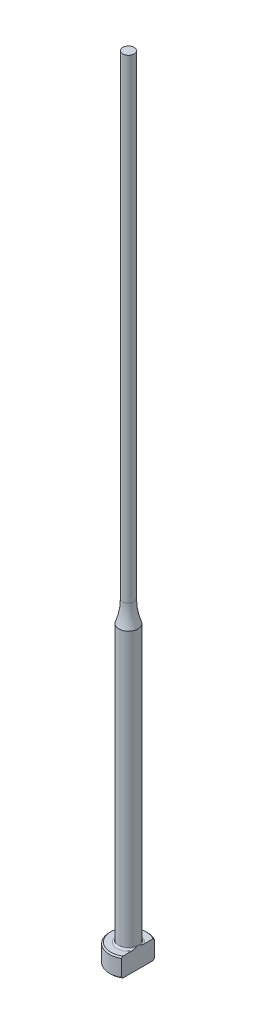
ISO-10303-21;
HEADER;
FILE_DESCRIPTION(('STEP AP214'),'2;1');
FILE_NAME('part.step','',(''),(''),'','','');
FILE_SCHEMA(('AUTOMOTIVE_DESIGN { 1 0 10303 214 1 1 1 1 }'));
ENDSEC;
DATA;
#1=APPLICATION_CONTEXT('core data for automotive mechanical design processes');
#2=APPLICATION_PROTOCOL_DEFINITION('international standard','automotive_design',2000,#1);
#3=PRODUCT_CONTEXT('',#1,'mechanical');
#4=PRODUCT('Part','Part','',(#3));
#5=PRODUCT_RELATED_PRODUCT_CATEGORY('part','',(#4));
#6=PRODUCT_DEFINITION_FORMATION('','',#4);
#7=PRODUCT_DEFINITION_CONTEXT('part definition',#1,'design');
#8=PRODUCT_DEFINITION('design','',#6,#7);
#9=PRODUCT_DEFINITION_SHAPE('','',#8);
#10=(LENGTH_UNIT() NAMED_UNIT(*) SI_UNIT(.MILLI.,.METRE.));
#11=(NAMED_UNIT(*) PLANE_ANGLE_UNIT() SI_UNIT($,.RADIAN.));
#12=(NAMED_UNIT(*) SI_UNIT($,.STERADIAN.) SOLID_ANGLE_UNIT());
#13=UNCERTAINTY_MEASURE_WITH_UNIT(LENGTH_MEASURE(1.E-05),#10,'distance_accuracy_value','');
#14=(GEOMETRIC_REPRESENTATION_CONTEXT(3) GLOBAL_UNCERTAINTY_ASSIGNED_CONTEXT((#13)) GLOBAL_UNIT_ASSIGNED_CONTEXT((#10,
#11,#12)) REPRESENTATION_CONTEXT('',''));
#15=CARTESIAN_POINT('',(0.,0.,0.));
#16=DIRECTION('',(0.,0.,1.));
#17=DIRECTION('',(1.,0.,0.));
#18=AXIS2_PLACEMENT_3D('',#15,#16,#17);
#19=CARTESIAN_POINT('',(-2.99999999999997,3.,0.));
#20=DIRECTION('',(0.,1.,0.));
#21=DIRECTION('',(0.,0.,1.));
#22=AXIS2_PLACEMENT_3D('',#19,#20,#21);
#23=PLANE('',#22);
#24=CARTESIAN_POINT('',(0.,3.,0.));
#25=DIRECTION('',(0.,1.,0.));
#26=DIRECTION('',(0.,0.,1.));
#27=AXIS2_PLACEMENT_3D('',#24,#25,#26);
#28=CIRCLE('',#27,2.79999999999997);
#29=CARTESIAN_POINT('',(1.49999999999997,3.,-2.36431808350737));
#30=VERTEX_POINT('',#29);
#31=CARTESIAN_POINT('',(1.49999999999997,3.,2.36431808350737));
#32=VERTEX_POINT('',#31);
#33=EDGE_CURVE('E187',#30,#32,#28,.T.);
#34=ORIENTED_EDGE('',*,*,#33,.T.);
#35=DIRECTION('',(0.,0.,-1.));
#36=VECTOR('',#35,1.);
#37=CARTESIAN_POINT('',(1.49999999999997,3.,0.));
#38=LINE('',#37,#36);
#39=CARTESIAN_POINT('',(1.49999999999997,3.00000000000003,0.99498743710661));
#40=VERTEX_POINT('',#39);
#41=EDGE_CURVE('E57',#32,#40,#38,.T.);
#42=ORIENTED_EDGE('',*,*,#41,.T.);
#43=CARTESIAN_POINT('',(0.,3.,0.));
#44=DIRECTION('',(0.,1.,0.));
#45=DIRECTION('',(0.,0.,1.));
#46=AXIS2_PLACEMENT_3D('',#43,#44,#45);
#47=CIRCLE('',#46,1.79999999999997);
#48=CARTESIAN_POINT('',(1.49999999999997,3.00000000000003,-0.994987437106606));
#49=VERTEX_POINT('',#48);
#50=EDGE_CURVE('E108',#40,#49,#47,.F.);
#51=ORIENTED_EDGE('',*,*,#50,.T.);
#52=EDGE_CURVE('E137',#49,#30,#38,.T.);
#53=ORIENTED_EDGE('',*,*,#52,.T.);
#54=EDGE_LOOP('',(#34,#42,#51,#53));
#55=FACE_BOUND('',#54,.T.);
#56=ADVANCED_FACE('F32',(#55),#23,.T.);
#57=CARTESIAN_POINT('',(0.,259.958771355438,0.));
#58=DIRECTION('',(0.,1.,0.));
#59=DIRECTION('',(0.,0.,1.));
#60=AXIS2_PLACEMENT_3D('',#57,#58,#59);
#61=CYLINDRICAL_SURFACE('',#60,2.99999999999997);
#62=CARTESIAN_POINT('',(0.,2.80000000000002,0.));
#63=DIRECTION('',(0.,1.,0.));
#64=DIRECTION('',(0.,0.,1.));
#65=AXIS2_PLACEMENT_3D('',#62,#63,#64);
#66=CIRCLE('',#65,2.99999999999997);
#67=CARTESIAN_POINT('',(1.49999999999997,2.80000000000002,2.5980762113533));
#68=VERTEX_POINT('',#67);
#69=CARTESIAN_POINT('',(1.49999999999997,2.80000000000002,-2.5980762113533));
#70=VERTEX_POINT('',#69);
#71=EDGE_CURVE('E105',#68,#70,#66,.F.);
#72=ORIENTED_EDGE('',*,*,#71,.T.);
#73=DIRECTION('',(0.,-1.,0.));
#74=VECTOR('',#73,1.);
#75=CARTESIAN_POINT('',(1.49999999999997,125.,-2.5980762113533));
#76=LINE('',#75,#74);
#77=CARTESIAN_POINT('',(1.49999999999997,0.200000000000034,-2.5980762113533));
#78=VERTEX_POINT('',#77);
#79=EDGE_CURVE('E193',#70,#78,#76,.T.);
#80=ORIENTED_EDGE('',*,*,#79,.T.);
#81=CARTESIAN_POINT('',(0.,0.200000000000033,0.));
#82=DIRECTION('',(0.,-1.,0.));
#83=DIRECTION('',(0.,0.,-1.));
#84=AXIS2_PLACEMENT_3D('',#81,#82,#83);
#85=CIRCLE('',#84,2.99999999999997);
#86=CARTESIAN_POINT('',(1.49999999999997,0.200000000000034,2.5980762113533));
#87=VERTEX_POINT('',#86);
#88=EDGE_CURVE('E100',#78,#87,#85,.F.);
#89=ORIENTED_EDGE('',*,*,#88,.T.);
#90=DIRECTION('',(0.,-1.,0.));
#91=VECTOR('',#90,1.);
#92=CARTESIAN_POINT('',(1.49999999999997,125.,2.5980762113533));
#93=LINE('',#92,#91);
#94=EDGE_CURVE('E93',#68,#87,#93,.T.);
#95=ORIENTED_EDGE('',*,*,#94,.F.);
#96=EDGE_LOOP('',(#72,#80,#89,#95));
#97=FACE_BOUND('',#96,.T.);
#98=ADVANCED_FACE('F158',(#97),#61,.T.);
#99=CARTESIAN_POINT('',(0.,0.,0.));
#100=DIRECTION('',(0.,-1.,0.));
#101=DIRECTION('',(0.,0.,-1.));
#102=AXIS2_PLACEMENT_3D('',#99,#100,#101);
#103=PLANE('',#102);
#104=CARTESIAN_POINT('',(0.,0.,0.));
#105=DIRECTION('',(0.,-1.,0.));
#106=DIRECTION('',(0.,0.,-1.));
#107=AXIS2_PLACEMENT_3D('',#104,#105,#106);
#108=CIRCLE('',#107,2.79999999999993);
#109=CARTESIAN_POINT('',(1.49999999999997,0.,2.36431808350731));
#110=VERTEX_POINT('',#109);
#111=CARTESIAN_POINT('',(1.49999999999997,0.,-2.36431808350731));
#112=VERTEX_POINT('',#111);
#113=EDGE_CURVE('E98',#110,#112,#108,.T.);
#114=ORIENTED_EDGE('',*,*,#113,.T.);
#115=DIRECTION('',(0.,0.,1.));
#116=VECTOR('',#115,1.);
#117=CARTESIAN_POINT('',(1.49999999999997,0.,-2.5980762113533));
#118=LINE('',#117,#116);
#119=EDGE_CURVE('E83',#112,#110,#118,.T.);
#120=ORIENTED_EDGE('',*,*,#119,.T.);
#121=EDGE_LOOP('',(#114,#120));
#122=FACE_BOUND('',#121,.T.);
#123=ADVANCED_FACE('F103',(#122),#103,.T.);
#124=CARTESIAN_POINT('',(0.,3.,0.));
#125=DIRECTION('',(0.,-1.,0.));
#126=DIRECTION('',(0.,0.,-1.));
#127=AXIS2_PLACEMENT_3D('',#124,#125,#126);
#128=CONICAL_SURFACE('',#127,2.79999999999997,0.7853981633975);
#129=ORIENTED_EDGE('',*,*,#71,.F.);
#130=CARTESIAN_POINT('',(1.49999999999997,-0.11174109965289,5.71827621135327));
#131=CARTESIAN_POINT('',(1.49999999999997,0.0136183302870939,5.58866816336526));
#132=CARTESIAN_POINT('',(1.49999999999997,0.138843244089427,5.45892957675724));
#133=CARTESIAN_POINT('',(1.49999999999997,0.388944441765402,5.19911365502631));
#134=CARTESIAN_POINT('',(1.49999999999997,0.513820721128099,5.06903631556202));
#135=CARTESIAN_POINT('',(1.49999999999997,0.763205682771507,4.8084018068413));
#136=CARTESIAN_POINT('',(1.49999999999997,0.887714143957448,4.67784442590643));
#137=CARTESIAN_POINT('',(1.49999999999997,1.13618059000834,4.41620813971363));
#138=CARTESIAN_POINT('',(1.49999999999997,1.2601385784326,4.28512923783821));
#139=CARTESIAN_POINT('',(1.49999999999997,1.50488975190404,4.02490837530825));
#140=CARTESIAN_POINT('',(1.49999999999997,1.6256969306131,3.89577958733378));
#141=CARTESIAN_POINT('',(1.49999999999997,1.86640694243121,3.63668213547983));
#142=CARTESIAN_POINT('',(1.49999999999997,1.98630978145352,3.5067134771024));
#143=CARTESIAN_POINT('',(1.49999999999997,2.22486033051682,3.24567921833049));
#144=CARTESIAN_POINT('',(1.49999999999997,2.34350830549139,3.11461386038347));
#145=CARTESIAN_POINT('',(1.49999999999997,2.57907716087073,2.85094268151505));
#146=CARTESIAN_POINT('',(1.49999999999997,2.69599811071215,2.71833692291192));
#147=CARTESIAN_POINT('',(1.49999999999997,2.88262371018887,2.50255231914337));
#148=CARTESIAN_POINT('',(1.49999999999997,2.95312454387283,2.42006293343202));
#149=CARTESIAN_POINT('',(1.49999999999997,3.09287098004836,2.25401084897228));
#150=CARTESIAN_POINT('',(1.49999999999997,3.16211645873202,2.170448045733));
#151=CARTESIAN_POINT('',(1.49999999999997,3.2996468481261,2.00105967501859));
#152=CARTESIAN_POINT('',(1.49999999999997,3.36791386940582,1.91521952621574));
#153=CARTESIAN_POINT('',(1.49999999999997,3.50205840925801,1.74171392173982));
#154=CARTESIAN_POINT('',(1.49999999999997,3.56793649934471,1.65404891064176));
#155=CARTESIAN_POINT('',(1.49999999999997,3.69728151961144,1.47490236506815));
#156=CARTESIAN_POINT('',(1.49999999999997,3.76069661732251,1.38338308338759));
#157=CARTESIAN_POINT('',(1.49999999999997,3.88239539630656,1.1967566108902));
#158=CARTESIAN_POINT('',(1.49999999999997,3.94067201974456,1.10164473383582));
#159=CARTESIAN_POINT('',(1.49999999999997,4.0484132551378,0.908008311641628));
#160=CARTESIAN_POINT('',(1.49999999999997,4.09797809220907,0.809540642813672));
#161=CARTESIAN_POINT('',(1.49999999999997,4.18432188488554,0.607192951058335));
#162=CARTESIAN_POINT('',(1.49999999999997,4.22114374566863,0.503332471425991));
#163=CARTESIAN_POINT('',(1.49999999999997,4.26099935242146,0.347577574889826));
#164=CARTESIAN_POINT('',(1.49999999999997,4.27157029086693,0.29760995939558));
#165=CARTESIAN_POINT('',(1.49999999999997,4.28794860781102,0.196885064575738));
#166=CARTESIAN_POINT('',(1.49999999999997,4.29375640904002,0.146127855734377));
#167=CARTESIAN_POINT('',(1.49999999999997,4.30019707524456,0.0444388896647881));
#168=CARTESIAN_POINT('',(1.49999999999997,4.30084594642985,-0.00649183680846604));
#169=CARTESIAN_POINT('',(1.49999999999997,4.29696416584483,-0.108155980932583));
#170=CARTESIAN_POINT('',(1.49999999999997,4.29243308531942,-0.158889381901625));
#171=CARTESIAN_POINT('',(1.49999999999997,4.27856915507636,-0.259234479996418));
#172=CARTESIAN_POINT('',(1.49999999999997,4.26927821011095,-0.308852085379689));
#173=CARTESIAN_POINT('',(1.49999999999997,4.24647108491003,-0.407110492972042));
#174=CARTESIAN_POINT('',(1.49999999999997,4.2329532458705,-0.455750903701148));
#175=CARTESIAN_POINT('',(1.49999999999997,4.20226175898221,-0.552149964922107));
#176=CARTESIAN_POINT('',(1.49999999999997,4.18506801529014,-0.599902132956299));
#177=CARTESIAN_POINT('',(1.49999999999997,4.14771387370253,-0.694205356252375));
#178=CARTESIAN_POINT('',(1.49999999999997,4.12755408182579,-0.740756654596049));
#179=CARTESIAN_POINT('',(1.49999999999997,4.06327696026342,-0.879166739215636));
#180=CARTESIAN_POINT('',(1.49999999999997,4.01551721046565,-0.969329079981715));
#181=CARTESIAN_POINT('',(1.49999999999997,3.91367909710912,-1.1460431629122));
#182=CARTESIAN_POINT('',(1.49999999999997,3.85959300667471,-1.23259031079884));
#183=CARTESIAN_POINT('',(1.49999999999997,3.74697968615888,-1.40321348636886));
#184=CARTESIAN_POINT('',(1.49999999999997,3.68843573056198,-1.48727838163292));
#185=CARTESIAN_POINT('',(1.49999999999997,3.56843845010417,-1.65322187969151));
#186=CARTESIAN_POINT('',(1.49999999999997,3.50698656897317,-1.73510153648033));
#187=CARTESIAN_POINT('',(1.49999999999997,3.38115673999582,-1.89829823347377));
#188=CARTESIAN_POINT('',(1.49999999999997,3.31675092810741,-1.9795936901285));
#189=CARTESIAN_POINT('',(1.49999999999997,3.18634068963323,-2.14090082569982));
#190=CARTESIAN_POINT('',(1.49999999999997,3.12033609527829,-2.22091236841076));
#191=CARTESIAN_POINT('',(1.49999999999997,2.9208643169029,-2.4590650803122));
#192=CARTESIAN_POINT('',(1.49999999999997,2.78562663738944,-2.6157209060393));
#193=CARTESIAN_POINT('',(1.49999999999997,2.53554498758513,-2.90006295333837));
#194=CARTESIAN_POINT('',(1.49999999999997,2.421145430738,-3.02814382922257));
#195=CARTESIAN_POINT('',(1.49999999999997,2.19093557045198,-3.28303767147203));
#196=CARTESIAN_POINT('',(1.49999999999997,2.07512522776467,-3.40985060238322));
#197=CARTESIAN_POINT('',(1.49999999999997,1.72597067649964,-3.78913849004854));
#198=CARTESIAN_POINT('',(1.49999999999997,1.49111760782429,-4.04022177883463));
#199=CARTESIAN_POINT('',(1.49999999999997,1.02882478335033,-4.52992803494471));
#200=CARTESIAN_POINT('',(1.49999999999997,0.801477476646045,-4.76863870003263));
#201=CARTESIAN_POINT('',(1.49999999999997,0.459548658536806,-5.12558036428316));
#202=CARTESIAN_POINT('',(1.49999999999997,0.345484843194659,-5.24430773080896));
#203=CARTESIAN_POINT('',(1.49999999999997,0.117071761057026,-5.48148573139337));
#204=CARTESIAN_POINT('',(1.49999999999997,0.00272249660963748,-5.59993636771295));
#205=CARTESIAN_POINT('',(1.49999999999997,-0.111741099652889,-5.71827621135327));
#206=B_SPLINE_CURVE_WITH_KNOTS('',3,(#130,#131,#132,#133,#134,#135,#136,#137,#138,#139,#140,
#141,#142,#143,#144,#145,#146,#147,#148,#149,#150,#151,#152,#153,#154,#155,#156,#157,#158,#159,
#160,#161,#162,#163,#164,#165,#166,#167,#168,#169,#170,#171,#172,#173,#174,#175,#176,#177,#178,
#179,#180,#181,#182,#183,#184,#185,#186,#187,#188,#189,#190,#191,#192,#193,#194,#195,#196,#197,
#198,#199,#200,#201,#202,#203,#204,#205),.UNSPECIFIED.,.F.,.F.,(4,2,2,2,2,2,2,2,2,2,2,2,2,2,2,2,
2,2,2,2,2,2,2,2,2,2,2,2,2,2,2,2,2,2,2,2,2,4),(0.,0.540943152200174,1.08189327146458,
1.62312052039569,2.16434426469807,2.69482920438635,3.22531067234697,3.75567781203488,
4.28602356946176,4.61155053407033,4.93710943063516,5.26610945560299,5.59503024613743,
5.92894782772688,6.26331713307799,6.59354403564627,6.92264800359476,7.07567478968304,
7.22868799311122,7.38122626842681,7.53377717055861,7.68500755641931,7.83629736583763,
7.98843643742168,8.14054446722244,8.4461879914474,8.75220879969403,9.05944044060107,
9.366521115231,9.677642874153,9.98879742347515,10.6095925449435,11.1247803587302,
11.6399825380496,12.6713544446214,13.6603005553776,14.1542238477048,14.648143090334),.UNSPECIFIED.);
#207=EDGE_CURVE('E136',#68,#32,#206,.T.);
#208=ORIENTED_EDGE('',*,*,#207,.T.);
#209=ORIENTED_EDGE('',*,*,#33,.F.);
#210=EDGE_CURVE('E128',#30,#70,#206,.T.);
#211=ORIENTED_EDGE('',*,*,#210,.T.);
#212=EDGE_LOOP('',(#129,#208,#209,#211));
#213=FACE_BOUND('',#212,.T.);
#214=ADVANCED_FACE('F144',(#213),#128,.T.);
#215=CARTESIAN_POINT('',(0.,0.200000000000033,0.));
#216=DIRECTION('',(0.,1.,0.));
#217=DIRECTION('',(0.,0.,1.));
#218=AXIS2_PLACEMENT_3D('',#215,#216,#217);
#219=CONICAL_SURFACE('',#218,2.99999999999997,0.785398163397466);
#220=ORIENTED_EDGE('',*,*,#88,.F.);
#221=CARTESIAN_POINT('',(1.49999999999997,3.11174109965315,-5.71827621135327));
#222=CARTESIAN_POINT('',(1.49999999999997,2.98638166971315,-5.58866816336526));
#223=CARTESIAN_POINT('',(1.49999999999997,2.8611567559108,-5.45892957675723));
#224=CARTESIAN_POINT('',(1.49999999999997,2.6110555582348,-5.19911365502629));
#225=CARTESIAN_POINT('',(1.49999999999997,2.48617927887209,-5.06903631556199));
#226=CARTESIAN_POINT('',(1.49999999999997,2.23679431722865,-4.80840180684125));
#227=CARTESIAN_POINT('',(1.49999999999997,2.11228585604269,-4.67784442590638));
#228=CARTESIAN_POINT('',(1.49999999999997,1.86381940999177,-4.41620813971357));
#229=CARTESIAN_POINT('',(1.49999999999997,1.7398614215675,-4.28512923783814));
#230=CARTESIAN_POINT('',(1.49999999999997,1.49511024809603,-4.02490837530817));
#231=CARTESIAN_POINT('',(1.49999999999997,1.37430306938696,-3.89577958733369));
#232=CARTESIAN_POINT('',(1.49999999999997,1.13359305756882,-3.63668213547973));
#233=CARTESIAN_POINT('',(1.49999999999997,1.0136902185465,-3.50671347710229));
#234=CARTESIAN_POINT('',(1.49999999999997,0.775139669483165,-3.24567921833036));
#235=CARTESIAN_POINT('',(1.49999999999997,0.656491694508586,-3.11461386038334));
#236=CARTESIAN_POINT('',(1.49999999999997,0.420922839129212,-2.85094268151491));
#237=CARTESIAN_POINT('',(1.49999999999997,0.304001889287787,-2.71833692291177));
#238=CARTESIAN_POINT('',(1.49999999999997,0.117376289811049,-2.50255231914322));
#239=CARTESIAN_POINT('',(1.49999999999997,0.0468754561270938,-2.42006293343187));
#240=CARTESIAN_POINT('',(1.49999999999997,-0.0928709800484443,-2.25401084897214));
#241=CARTESIAN_POINT('',(1.49999999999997,-0.162116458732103,-2.17044804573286));
#242=CARTESIAN_POINT('',(1.49999999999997,-0.299646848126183,-2.00105967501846));
#243=CARTESIAN_POINT('',(1.49999999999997,-0.367913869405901,-1.91521952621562));
#244=CARTESIAN_POINT('',(1.49999999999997,-0.502058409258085,-1.74171392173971));
#245=CARTESIAN_POINT('',(1.49999999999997,-0.567936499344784,-1.65404891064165));
#246=CARTESIAN_POINT('',(1.49999999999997,-0.697281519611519,-1.47490236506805));
#247=CARTESIAN_POINT('',(1.49999999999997,-0.760696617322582,-1.38338308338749));
#248=CARTESIAN_POINT('',(1.49999999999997,-0.882395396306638,-1.19675661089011));
#249=CARTESIAN_POINT('',(1.49999999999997,-0.940672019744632,-1.10164473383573));
#250=CARTESIAN_POINT('',(1.49999999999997,-1.04841325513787,-0.908008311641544));
#251=CARTESIAN_POINT('',(1.49999999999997,-1.09797809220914,-0.809540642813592));
#252=CARTESIAN_POINT('',(1.49999999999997,-1.1843218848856,-0.60719295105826));
#253=CARTESIAN_POINT('',(1.49999999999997,-1.22114374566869,-0.503332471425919));
#254=CARTESIAN_POINT('',(1.49999999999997,-1.26099935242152,-0.347577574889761));
#255=CARTESIAN_POINT('',(1.49999999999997,-1.27157029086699,-0.29760995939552));
#256=CARTESIAN_POINT('',(1.49999999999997,-1.28794860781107,-0.196885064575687));
#257=CARTESIAN_POINT('',(1.49999999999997,-1.29375640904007,-0.146127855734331));
#258=CARTESIAN_POINT('',(1.49999999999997,-1.30019707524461,-0.0444388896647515));
#259=CARTESIAN_POINT('',(1.49999999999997,-1.3008459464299,0.00649183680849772));
#260=CARTESIAN_POINT('',(1.49999999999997,-1.29696416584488,0.108155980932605));
#261=CARTESIAN_POINT('',(1.49999999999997,-1.29243308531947,0.158889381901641));
#262=CARTESIAN_POINT('',(1.49999999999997,-1.2785691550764,0.259234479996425));
#263=CARTESIAN_POINT('',(1.49999999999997,-1.26927821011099,0.308852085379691));
#264=CARTESIAN_POINT('',(1.49999999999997,-1.24647108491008,0.407110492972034));
#265=CARTESIAN_POINT('',(1.49999999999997,-1.23295324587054,0.455750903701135));
#266=CARTESIAN_POINT('',(1.49999999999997,-1.20226175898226,0.552149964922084));
#267=CARTESIAN_POINT('',(1.49999999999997,-1.18506801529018,0.599902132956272));
#268=CARTESIAN_POINT('',(1.49999999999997,-1.14771387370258,0.694205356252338));
#269=CARTESIAN_POINT('',(1.49999999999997,-1.12755408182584,0.740756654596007));
#270=CARTESIAN_POINT('',(1.49999999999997,-1.06327696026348,0.879166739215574));
#271=CARTESIAN_POINT('',(1.49999999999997,-1.01551721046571,0.969329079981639));
#272=CARTESIAN_POINT('',(1.49999999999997,-0.913679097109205,1.1460431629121));
#273=CARTESIAN_POINT('',(1.49999999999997,-0.8595930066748,1.23259031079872));
#274=CARTESIAN_POINT('',(1.49999999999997,-0.746979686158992,1.40321348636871));
#275=CARTESIAN_POINT('',(1.49999999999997,-0.688435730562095,1.48727838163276));
#276=CARTESIAN_POINT('',(1.49999999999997,-0.568438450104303,1.65322187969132));
#277=CARTESIAN_POINT('',(1.49999999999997,-0.506986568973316,1.73510153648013));
#278=CARTESIAN_POINT('',(1.49999999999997,-0.381156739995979,1.89829823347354));
#279=CARTESIAN_POINT('',(1.49999999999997,-0.316750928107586,1.97959369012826));
#280=CARTESIAN_POINT('',(1.49999999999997,-0.186340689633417,2.14090082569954));
#281=CARTESIAN_POINT('',(1.49999999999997,-0.120336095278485,2.22091236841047));
#282=CARTESIAN_POINT('',(1.49999999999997,0.0791356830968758,2.45906508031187));
#283=CARTESIAN_POINT('',(1.49999999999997,0.214373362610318,2.61572090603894));
#284=CARTESIAN_POINT('',(1.49999999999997,0.46445501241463,2.90006295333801));
#285=CARTESIAN_POINT('',(1.49999999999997,0.578854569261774,3.02814382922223));
#286=CARTESIAN_POINT('',(1.49999999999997,0.809064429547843,3.28303767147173));
#287=CARTESIAN_POINT('',(1.49999999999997,0.924874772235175,3.40985060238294));
#288=CARTESIAN_POINT('',(1.49999999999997,1.27402932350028,3.78913849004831));
#289=CARTESIAN_POINT('',(1.49999999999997,1.50888239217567,4.04022177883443));
#290=CARTESIAN_POINT('',(1.49999999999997,1.97117521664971,4.52992803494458));
#291=CARTESIAN_POINT('',(1.49999999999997,2.19852252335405,4.76863870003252));
#292=CARTESIAN_POINT('',(1.49999999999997,2.54045134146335,5.12558036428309));
#293=CARTESIAN_POINT('',(1.49999999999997,2.65451515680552,5.2443077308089));
#294=CARTESIAN_POINT('',(1.49999999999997,2.88292823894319,5.48148573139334));
#295=CARTESIAN_POINT('',(1.49999999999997,2.9972775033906,5.59993636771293));
#296=CARTESIAN_POINT('',(1.49999999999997,3.11174109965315,5.71827621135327));
#297=B_SPLINE_CURVE_WITH_KNOTS('',3,(#221,#222,#223,#224,#225,#226,#227,#228,#229,#230,#231,
#232,#233,#234,#235,#236,#237,#238,#239,#240,#241,#242,#243,#244,#245,#246,#247,#248,#249,#250,
#251,#252,#253,#254,#255,#256,#257,#258,#259,#260,#261,#262,#263,#264,#265,#266,#267,#268,#269,
#270,#271,#272,#273,#274,#275,#276,#277,#278,#279,#280,#281,#282,#283,#284,#285,#286,#287,#288,
#289,#290,#291,#292,#293,#294,#295,#296),.UNSPECIFIED.,.F.,.F.,(4,2,2,2,2,2,2,2,2,2,2,2,2,2,2,2,
2,2,2,2,2,2,2,2,2,2,2,2,2,2,2,2,2,2,2,2,2,4),(0.,0.540943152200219,1.08189327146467,
1.62312052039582,2.16434426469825,2.69482920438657,3.22531067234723,3.75567781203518,
4.28602356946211,4.61155053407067,4.93710943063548,5.2661094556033,5.59503024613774,
5.92894782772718,6.26331713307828,6.59354403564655,6.92264800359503,7.0756747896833,
7.22868799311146,7.38122626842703,7.53377717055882,7.68500755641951,7.83629736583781,
7.98843643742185,8.14054446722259,8.4461879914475,8.75220879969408,9.05944044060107,
9.36652111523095,9.6776428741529,9.98879742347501,10.6095925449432,11.1247803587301,
11.6399825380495,12.6713544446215,13.6603005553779,14.1542238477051,14.6481430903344),.UNSPECIFIED.);
#298=EDGE_CURVE('E86',#78,#112,#297,.T.);
#299=ORIENTED_EDGE('',*,*,#298,.T.);
#300=ORIENTED_EDGE('',*,*,#113,.F.);
#301=EDGE_CURVE('E89',#110,#87,#297,.T.);
#302=ORIENTED_EDGE('',*,*,#301,.T.);
#303=EDGE_LOOP('',(#220,#299,#300,#302));
#304=FACE_BOUND('',#303,.T.);
#305=ADVANCED_FACE('F97',(#304),#219,.T.);
#306=CARTESIAN_POINT('',(0.,3.30000000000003,0.));
#307=DIRECTION('',(0.,1.,0.));
#308=DIRECTION('',(0.,0.,1.));
#309=AXIS2_PLACEMENT_3D('',#306,#307,#308);
#310=TOROIDAL_SURFACE('',#309,1.79999999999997,0.3);
#311=CARTESIAN_POINT('',(1.49999999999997,3.30000000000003,0.));
#312=CARTESIAN_POINT('',(1.49999999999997,3.300000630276,3.41555678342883E-12));
#313=CARTESIAN_POINT('',(1.49999999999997,3.30000126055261,-1.15373640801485E-07));
#314=CARTESIAN_POINT('',(1.49999999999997,3.3000024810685,-4.90631575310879E-07));
#315=CARTESIAN_POINT('',(1.49999999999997,3.30000307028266,-7.53296670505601E-07));
#316=CARTESIAN_POINT('',(1.49999999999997,3.30000424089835,-1.38757096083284E-06));
#317=CARTESIAN_POINT('',(1.49999999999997,3.300004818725,-1.76563001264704E-06));
#318=CARTESIAN_POINT('',(1.49999999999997,3.30000591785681,-2.58768006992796E-06));
#319=CARTESIAN_POINT('',(1.49999999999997,3.30000643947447,-3.03127014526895E-06));
#320=CARTESIAN_POINT('',(1.49999999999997,3.30000815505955,-4.60021967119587E-06));
#321=CARTESIAN_POINT('',(1.49999999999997,3.30000927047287,-5.8124152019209E-06));
#322=CARTESIAN_POINT('',(1.49999999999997,3.30001128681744,-8.33989413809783E-06));
#323=CARTESIAN_POINT('',(1.49999999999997,3.30001219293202,-9.65128157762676E-06));
#324=CARTESIAN_POINT('',(1.49999999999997,3.30001551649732,-1.46782505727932E-05));
#325=CARTESIAN_POINT('',(1.49999999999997,3.30001775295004,-1.8517976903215E-05));
#326=CARTESIAN_POINT('',(1.49999999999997,3.30002148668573,-2.61616194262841E-05));
#327=CARTESIAN_POINT('',(1.49999999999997,3.30002302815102,-2.99447742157E-05));
#328=CARTESIAN_POINT('',(1.49999999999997,3.30002943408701,-4.58003743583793E-05));
#329=CARTESIAN_POINT('',(1.49999999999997,3.3000341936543,-5.79079078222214E-05));
#330=CARTESIAN_POINT('',(1.49999999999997,3.30004197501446,-8.07263755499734E-05));
#331=CARTESIAN_POINT('',(1.49999999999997,3.30004514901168,-9.13834709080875E-05));
#332=CARTESIAN_POINT('',(1.49999999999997,3.30006989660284,-0.000167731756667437));
#333=CARTESIAN_POINT('',(1.49999999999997,3.30010092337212,-0.000229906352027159));
#334=CARTESIAN_POINT('',(1.49999999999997,3.30021632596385,-0.000470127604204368));
#335=CARTESIAN_POINT('',(1.49999999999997,3.30029368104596,-0.000650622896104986));
#336=CARTESIAN_POINT('',(1.49999999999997,3.30059619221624,-0.00134589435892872));
#337=CARTESIAN_POINT('',(1.49999999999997,3.30082870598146,-0.00185814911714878));
#338=CARTESIAN_POINT('',(1.49999999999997,3.30176696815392,-0.00393547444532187));
#339=CARTESIAN_POINT('',(1.49999999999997,3.30246445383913,-0.00550332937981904));
#340=CARTESIAN_POINT('',(1.49999999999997,3.31426785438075,-0.0320229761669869));
#341=CARTESIAN_POINT('',(1.49999999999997,3.32544800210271,-0.0569503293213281));
#342=CARTESIAN_POINT('',(1.49999999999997,3.34725700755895,-0.105984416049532));
#343=CARTESIAN_POINT('',(1.49999999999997,3.35789134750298,-0.130088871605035));
#344=CARTESIAN_POINT('',(1.49999999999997,3.38015321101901,-0.181096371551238));
#345=CARTESIAN_POINT('',(1.49999999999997,3.39175804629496,-0.208009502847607));
#346=CARTESIAN_POINT('',(1.49999999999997,3.41469034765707,-0.262264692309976));
#347=CARTESIAN_POINT('',(1.49999999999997,3.42601398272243,-0.289608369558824));
#348=CARTESIAN_POINT('',(1.49999999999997,3.45363212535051,-0.35820378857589));
#349=CARTESIAN_POINT('',(1.49999999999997,3.46959026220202,-0.39959288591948));
#350=CARTESIAN_POINT('',(1.49999999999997,3.49940505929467,-0.482097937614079));
#351=CARTESIAN_POINT('',(1.49999999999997,3.51330033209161,-0.523199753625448));
#352=CARTESIAN_POINT('',(1.49999999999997,3.53552507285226,-0.595497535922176));
#353=CARTESIAN_POINT('',(1.49999999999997,3.54436834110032,-0.626532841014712));
#354=CARTESIAN_POINT('',(1.49999999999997,3.56052427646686,-0.6891760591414));
#355=CARTESIAN_POINT('',(1.49999999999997,3.5678279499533,-0.720786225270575));
#356=CARTESIAN_POINT('',(1.49999999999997,3.5875075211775,-0.819524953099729));
#357=CARTESIAN_POINT('',(1.49999999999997,3.59661044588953,-0.88742909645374));
#358=CARTESIAN_POINT('',(1.49999999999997,3.60059842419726,-0.991180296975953));
#359=CARTESIAN_POINT('',(1.49999999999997,3.60019840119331,-1.02684364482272));
#360=CARTESIAN_POINT('',(1.49999999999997,3.59497085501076,-1.097505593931));
#361=CARTESIAN_POINT('',(1.49999999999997,3.59019295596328,-1.13250716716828));
#362=CARTESIAN_POINT('',(1.49999999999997,3.57687734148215,-1.19353096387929));
#363=CARTESIAN_POINT('',(1.49999999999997,3.56943875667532,-1.21978854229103));
#364=CARTESIAN_POINT('',(1.49999999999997,3.55063748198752,-1.27094658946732));
#365=CARTESIAN_POINT('',(1.49999999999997,3.53927342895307,-1.29584658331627));
#366=CARTESIAN_POINT('',(1.49999999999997,3.51660016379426,-1.33501873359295));
#367=CARTESIAN_POINT('',(1.49999999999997,3.50657738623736,-1.35003296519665));
#368=CARTESIAN_POINT('',(1.49999999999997,3.48437469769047,-1.37837252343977));
#369=CARTESIAN_POINT('',(1.49999999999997,3.47219867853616,-1.39170082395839));
#370=CARTESIAN_POINT('',(1.49999999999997,3.44835614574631,-1.41349417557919));
#371=CARTESIAN_POINT('',(1.49999999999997,3.43709185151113,-1.42239673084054));
#372=CARTESIAN_POINT('',(1.49999999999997,3.41325256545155,-1.43825467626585));
#373=CARTESIAN_POINT('',(1.49999999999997,3.40067804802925,-1.44521076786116));
#374=CARTESIAN_POINT('',(1.49999999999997,3.37433767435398,-1.45677158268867));
#375=CARTESIAN_POINT('',(1.49999999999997,3.36056203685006,-1.46135438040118));
#376=CARTESIAN_POINT('',(1.49999999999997,3.33237324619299,-1.46767730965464));
#377=CARTESIAN_POINT('',(1.49999999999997,3.31796076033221,-1.46942034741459));
#378=CARTESIAN_POINT('',(1.49999999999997,3.29122479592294,-1.4698720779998));
#379=CARTESIAN_POINT('',(1.49999999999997,3.27890664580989,-1.468990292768));
#380=CARTESIAN_POINT('',(1.49999999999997,3.25461019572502,-1.4651157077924));
#381=CARTESIAN_POINT('',(1.49999999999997,3.2426318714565,-1.46212305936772));
#382=CARTESIAN_POINT('',(1.49999999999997,3.21959683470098,-1.4543117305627));
#383=CARTESIAN_POINT('',(1.49999999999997,3.20852542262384,-1.44953579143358));
#384=CARTESIAN_POINT('',(1.49999999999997,3.18721125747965,-1.43840957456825));
#385=CARTESIAN_POINT('',(1.49999999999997,3.1769687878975,-1.43205876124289));
#386=CARTESIAN_POINT('',(1.49999999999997,3.15325976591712,-1.41506353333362));
#387=CARTESIAN_POINT('',(1.49999999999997,3.14027750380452,-1.40374235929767));
#388=CARTESIAN_POINT('',(1.49999999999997,3.11630720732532,-1.37914825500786));
#389=CARTESIAN_POINT('',(1.49999999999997,3.10532420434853,-1.36587054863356));
#390=CARTESIAN_POINT('',(1.49999999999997,3.08100891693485,-1.33197272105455));
#391=CARTESIAN_POINT('',(1.49999999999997,3.06867625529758,-1.31063843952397));
#392=CARTESIAN_POINT('',(1.49999999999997,3.04751867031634,-1.26637455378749));
#393=CARTESIAN_POINT('',(1.49999999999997,3.03869240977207,-1.24344556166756));
#394=CARTESIAN_POINT('',(1.49999999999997,3.01978360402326,-1.18316534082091));
#395=CARTESIAN_POINT('',(1.49999999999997,3.01191472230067,-1.14512623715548));
#396=CARTESIAN_POINT('',(1.49999999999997,3.00188285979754,-1.06789971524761));
#397=CARTESIAN_POINT('',(1.49999999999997,2.99979735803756,-1.02870374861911));
#398=CARTESIAN_POINT('',(1.49999999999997,3.00021727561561,-0.953160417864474));
#399=CARTESIAN_POINT('',(1.49999999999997,3.00240673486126,-0.916808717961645));
#400=CARTESIAN_POINT('',(1.49999999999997,3.0099643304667,-0.844432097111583));
#401=CARTESIAN_POINT('',(1.49999999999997,3.01533462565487,-0.808407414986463));
#402=CARTESIAN_POINT('',(1.49999999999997,3.02828086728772,-0.738670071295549));
#403=CARTESIAN_POINT('',(1.49999999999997,3.03573028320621,-0.704933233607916));
#404=CARTESIAN_POINT('',(1.49999999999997,3.05243174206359,-0.638128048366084));
#405=CARTESIAN_POINT('',(1.49999999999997,3.06167285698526,-0.605056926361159));
#406=CARTESIAN_POINT('',(1.49999999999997,3.08440652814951,-0.53019513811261));
#407=CARTESIAN_POINT('',(1.49999999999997,3.09836576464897,-0.488547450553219));
#408=CARTESIAN_POINT('',(1.49999999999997,3.1283820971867,-0.404954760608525));
#409=CARTESIAN_POINT('',(1.49999999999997,3.14447968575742,-0.363024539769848));
#410=CARTESIAN_POINT('',(1.49999999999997,3.17238454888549,-0.293508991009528));
#411=CARTESIAN_POINT('',(1.49999999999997,3.18384249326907,-0.265781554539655));
#412=CARTESIAN_POINT('',(1.49999999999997,3.20705854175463,-0.210769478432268));
#413=CARTESIAN_POINT('',(1.49999999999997,3.21881265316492,-0.183483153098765));
#414=CARTESIAN_POINT('',(1.49999999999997,3.24136702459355,-0.131772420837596));
#415=CARTESIAN_POINT('',(1.49999999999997,3.25214361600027,-0.107337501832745));
#416=CARTESIAN_POINT('',(1.49999999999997,3.27424746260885,-0.0576321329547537));
#417=CARTESIAN_POINT('',(1.49999999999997,3.28558038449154,-0.0323640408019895));
#418=CARTESIAN_POINT('',(1.49999999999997,3.29753556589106,-0.00550327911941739));
#419=CARTESIAN_POINT('',(1.49999999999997,3.29823307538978,-0.00393537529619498));
#420=CARTESIAN_POINT('',(1.49999999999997,3.29917134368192,-0.00185803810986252));
#421=CARTESIAN_POINT('',(1.49999999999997,3.29940384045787,-0.00134582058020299));
#422=CARTESIAN_POINT('',(1.49999999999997,3.29970633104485,-0.000650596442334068));
#423=CARTESIAN_POINT('',(1.49999999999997,3.29978368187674,-0.000470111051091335));
#424=CARTESIAN_POINT('',(1.49999999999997,3.29989907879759,-0.000229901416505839));
#425=CARTESIAN_POINT('',(1.49999999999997,3.29993010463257,-0.000167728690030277));
#426=CARTESIAN_POINT('',(1.49999999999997,3.29995485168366,-9.13825689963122E-05));
#427=CARTESIAN_POINT('',(1.49999999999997,3.29995802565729,-8.07256241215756E-05));
#428=CARTESIAN_POINT('',(1.49999999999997,3.29996580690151,-5.79074820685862E-05));
#429=CARTESIAN_POINT('',(1.49999999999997,3.29997056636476,-4.5800119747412E-05));
#430=CARTESIAN_POINT('',(1.49999999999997,3.29997697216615,-2.99447119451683E-05));
#431=CARTESIAN_POINT('',(1.49999999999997,3.2999785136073,-2.61615817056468E-05));
#432=CARTESIAN_POINT('',(1.49999999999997,3.2999822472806,-1.85179845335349E-05));
#433=CARTESIAN_POINT('',(1.49999999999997,3.29998448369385,-1.46782782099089E-05));
#434=CARTESIAN_POINT('',(1.49999999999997,3.2999878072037,-9.65132752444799E-06));
#435=CARTESIAN_POINT('',(1.49999999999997,3.299988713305,-8.33994202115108E-06));
#436=CARTESIAN_POINT('',(1.49999999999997,3.29999072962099,-5.81246426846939E-06));
#437=CARTESIAN_POINT('',(1.49999999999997,3.29999184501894,-4.600267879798E-06));
#438=CARTESIAN_POINT('',(1.49999999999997,3.29999356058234,-3.03131394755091E-06));
#439=CARTESIAN_POINT('',(1.49999999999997,3.29999408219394,-2.58772196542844E-06));
#440=CARTESIAN_POINT('',(1.49999999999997,3.2999951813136,-1.76566701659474E-06));
#441=CARTESIAN_POINT('',(1.49999999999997,3.29999575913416,-1.38760497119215E-06));
#442=CARTESIAN_POINT('',(1.49999999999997,3.29999692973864,-7.53323425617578E-07));
#443=CARTESIAN_POINT('',(1.49999999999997,3.29999751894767,-4.90654189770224E-07));
#444=CARTESIAN_POINT('',(1.49999999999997,3.29999873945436,-1.15386267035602E-07));
#445=CARTESIAN_POINT('',(1.49999999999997,3.29999936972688,-3.41554144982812E-12));
#446=CARTESIAN_POINT('',(1.49999999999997,3.30000000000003,0.));
#447=B_SPLINE_CURVE_WITH_KNOTS('',3,(#311,#312,#313,#314,#315,#316,#317,#318,#319,#320,#321,
#322,#323,#324,#325,#326,#327,#328,#329,#330,#331,#332,#333,#334,#335,#336,#337,#338,#339,#340,
#341,#342,#343,#344,#345,#346,#347,#348,#349,#350,#351,#352,#353,#354,#355,#356,#357,#358,#359,
#360,#361,#362,#363,#364,#365,#366,#367,#368,#369,#370,#371,#372,#373,#374,#375,#376,#377,#378,
#379,#380,#381,#382,#383,#384,#385,#386,#387,#388,#389,#390,#391,#392,#393,#394,#395,#396,#397,
#398,#399,#400,#401,#402,#403,#404,#405,#406,#407,#408,#409,#410,#411,#412,#413,#414,#415,#416,
#417,#418,#419,#420,#421,#422,#423,#424,#425,#426,#427,#428,#429,#430,#431,#432,#433,#434,#435,
#436,#437,#438,#439,#440,#441,#442,#443,#444,#445,#446),.UNSPECIFIED.,.T.,.F.,(4,2,2,2,2,2,2,2,
2,2,2,2,2,2,2,2,2,2,2,2,2,2,2,2,2,2,2,2,2,2,2,2,2,2,2,2,2,2,2,2,2,2,2,2,2,2,2,2,2,2,2,2,2,2,2,2,
2,2,2,2,2,2,2,2,2,2,2,4),(0.,1.88906036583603E-06,3.8150959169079E-06,5.87892837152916E-06,
7.93062024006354E-06,1.28480890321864E-05,1.76261717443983E-05,3.0909918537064E-05,
4.31529750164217E-05,8.21699329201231E-05,0.000115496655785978,0.000323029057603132,
0.000912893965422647,0.00259963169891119,0.00774858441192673,0.0896975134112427,
0.168737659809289,0.256660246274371,0.345444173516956,0.478492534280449,0.608603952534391,
0.705372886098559,0.802692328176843,1.00719557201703,1.11399616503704,1.21960092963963,
1.30124317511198,1.38291380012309,1.43690814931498,1.49080588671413,1.53371524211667,
1.57660911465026,1.61989249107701,1.66313154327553,1.69999492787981,1.73685567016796,
1.77288440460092,1.80892540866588,1.86031324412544,1.91182866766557,1.98534297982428,
2.05882922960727,2.1747172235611,2.29215041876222,2.40123170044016,2.51038710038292,
2.613972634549,2.71694519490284,2.84866234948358,2.98337525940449,3.07337666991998,
3.16250453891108,3.24262397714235,3.32569301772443,3.3308421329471,3.33252874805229,
3.33311858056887,3.33332610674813,3.33335943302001,3.33339844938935,3.3334106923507,
3.33342397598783,3.33342875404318,3.33343367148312,3.33343572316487,3.33343778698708,
3.33343971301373,3.33344160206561),.UNSPECIFIED.);
#448=CARTESIAN_POINT('',(1.49999999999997,3.30000000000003,0.));
#449=VERTEX_POINT('',#448);
#450=EDGE_CURVE('E11',#49,#449,#447,.T.);
#451=ORIENTED_EDGE('',*,*,#450,.F.);
#452=ORIENTED_EDGE('',*,*,#50,.F.);
#453=CARTESIAN_POINT('',(1.49999999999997,3.30000000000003,0.));
#454=CARTESIAN_POINT('',(1.49999999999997,3.29999936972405,-3.41547770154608E-12));
#455=CARTESIAN_POINT('',(1.49999999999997,3.29999873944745,1.15373640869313E-07));
#456=CARTESIAN_POINT('',(1.49999999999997,3.29999751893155,4.90631575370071E-07));
#457=CARTESIAN_POINT('',(1.49999999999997,3.29999692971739,7.53296670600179E-07));
#458=CARTESIAN_POINT('',(1.49999999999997,3.2999957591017,1.38757096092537E-06));
#459=CARTESIAN_POINT('',(1.49999999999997,3.29999518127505,1.76563001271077E-06));
#460=CARTESIAN_POINT('',(1.49999999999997,3.29999408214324,2.58768007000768E-06));
#461=CARTESIAN_POINT('',(1.49999999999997,3.29999356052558,3.03127014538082E-06));
#462=CARTESIAN_POINT('',(1.49999999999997,3.2999918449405,4.60021967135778E-06));
#463=CARTESIAN_POINT('',(1.49999999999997,3.29999072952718,5.81241520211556E-06));
#464=CARTESIAN_POINT('',(1.49999999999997,3.29998871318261,8.33989413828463E-06));
#465=CARTESIAN_POINT('',(1.49999999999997,3.29998780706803,9.65128157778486E-06));
#466=CARTESIAN_POINT('',(1.49999999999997,3.29998448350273,1.46782505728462E-05));
#467=CARTESIAN_POINT('',(1.49999999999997,3.29998224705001,1.85179769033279E-05));
#468=CARTESIAN_POINT('',(1.49999999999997,3.29997851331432,2.61616194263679E-05));
#469=CARTESIAN_POINT('',(1.49999999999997,3.29997697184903,2.99447742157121E-05));
#470=CARTESIAN_POINT('',(1.49999999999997,3.29997056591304,4.58003743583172E-05));
#471=CARTESIAN_POINT('',(1.49999999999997,3.29996580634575,5.79079078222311E-05));
#472=CARTESIAN_POINT('',(1.49999999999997,3.29995802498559,8.07263755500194E-05));
#473=CARTESIAN_POINT('',(1.49999999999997,3.29995485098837,9.1383470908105E-05));
#474=CARTESIAN_POINT('',(1.49999999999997,3.29993010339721,0.000167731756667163));
#475=CARTESIAN_POINT('',(1.49999999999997,3.29989907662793,0.000229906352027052));
#476=CARTESIAN_POINT('',(1.49999999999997,3.2997836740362,0.000470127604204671));
#477=CARTESIAN_POINT('',(1.49999999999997,3.2997063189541,0.000650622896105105));
#478=CARTESIAN_POINT('',(1.49999999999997,3.29940380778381,0.00134589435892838));
#479=CARTESIAN_POINT('',(1.49999999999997,3.29917129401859,0.00185814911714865));
#480=CARTESIAN_POINT('',(1.49999999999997,3.29823303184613,0.00393547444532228));
#481=CARTESIAN_POINT('',(1.49999999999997,3.29753554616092,0.00550332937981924));
#482=CARTESIAN_POINT('',(1.49999999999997,3.2857321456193,0.0320229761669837));
#483=CARTESIAN_POINT('',(1.49999999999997,3.27455199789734,0.0569503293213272));
#484=CARTESIAN_POINT('',(1.49999999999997,3.2527429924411,0.105984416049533));
#485=CARTESIAN_POINT('',(1.49999999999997,3.24210865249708,0.130088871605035));
#486=CARTESIAN_POINT('',(1.49999999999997,3.21984678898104,0.181096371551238));
#487=CARTESIAN_POINT('',(1.49999999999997,3.20824195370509,0.208009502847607));
#488=CARTESIAN_POINT('',(1.49999999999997,3.18530965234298,0.262264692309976));
#489=CARTESIAN_POINT('',(1.49999999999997,3.17398601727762,0.289608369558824));
#490=CARTESIAN_POINT('',(1.49999999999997,3.14636787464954,0.35820378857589));
#491=CARTESIAN_POINT('',(1.49999999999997,3.13040973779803,0.39959288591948));
#492=CARTESIAN_POINT('',(1.49999999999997,3.10059494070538,0.482097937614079));
#493=CARTESIAN_POINT('',(1.49999999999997,3.08669966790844,0.523199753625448));
#494=CARTESIAN_POINT('',(1.49999999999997,3.06447492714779,0.595497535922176));
#495=CARTESIAN_POINT('',(1.49999999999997,3.05563165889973,0.626532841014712));
#496=CARTESIAN_POINT('',(1.49999999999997,3.03947572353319,0.6891760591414));
#497=CARTESIAN_POINT('',(1.49999999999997,3.03217205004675,0.720786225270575));
#498=CARTESIAN_POINT('',(1.49999999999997,3.01249247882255,0.819524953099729));
#499=CARTESIAN_POINT('',(1.49999999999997,3.00338955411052,0.88742909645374));
#500=CARTESIAN_POINT('',(1.49999999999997,2.99940157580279,0.991180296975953));
#501=CARTESIAN_POINT('',(1.49999999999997,2.99980159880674,1.02684364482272));
#502=CARTESIAN_POINT('',(1.49999999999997,3.00502914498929,1.097505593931));
#503=CARTESIAN_POINT('',(1.49999999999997,3.00980704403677,1.13250716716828));
#504=CARTESIAN_POINT('',(1.49999999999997,3.0231226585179,1.19353096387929));
#505=CARTESIAN_POINT('',(1.49999999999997,3.03056124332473,1.21978854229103));
#506=CARTESIAN_POINT('',(1.49999999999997,3.04936251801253,1.27094658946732));
#507=CARTESIAN_POINT('',(1.49999999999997,3.06072657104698,1.29584658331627));
#508=CARTESIAN_POINT('',(1.49999999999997,3.08339983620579,1.33501873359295));
#509=CARTESIAN_POINT('',(1.49999999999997,3.09342261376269,1.35003296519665));
#510=CARTESIAN_POINT('',(1.49999999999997,3.11562530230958,1.37837252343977));
#511=CARTESIAN_POINT('',(1.49999999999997,3.12780132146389,1.39170082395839));
#512=CARTESIAN_POINT('',(1.49999999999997,3.15164385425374,1.41349417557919));
#513=CARTESIAN_POINT('',(1.49999999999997,3.16290814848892,1.42239673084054));
#514=CARTESIAN_POINT('',(1.49999999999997,3.1867474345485,1.43825467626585));
#515=CARTESIAN_POINT('',(1.49999999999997,3.1993219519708,1.44521076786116));
#516=CARTESIAN_POINT('',(1.49999999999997,3.22566232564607,1.45677158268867));
#517=CARTESIAN_POINT('',(1.49999999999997,3.23943796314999,1.46135438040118));
#518=CARTESIAN_POINT('',(1.49999999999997,3.26762675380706,1.46767730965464));
#519=CARTESIAN_POINT('',(1.49999999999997,3.28203923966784,1.46942034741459));
#520=CARTESIAN_POINT('',(1.49999999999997,3.30877520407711,1.4698720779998));
#521=CARTESIAN_POINT('',(1.49999999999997,3.32109335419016,1.468990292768));
#522=CARTESIAN_POINT('',(1.49999999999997,3.34538980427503,1.4651157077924));
#523=CARTESIAN_POINT('',(1.49999999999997,3.35736812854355,1.46212305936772));
#524=CARTESIAN_POINT('',(1.49999999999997,3.38040316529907,1.4543117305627));
#525=CARTESIAN_POINT('',(1.49999999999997,3.39147457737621,1.44953579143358));
#526=CARTESIAN_POINT('',(1.49999999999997,3.4127887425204,1.43840957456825));
#527=CARTESIAN_POINT('',(1.49999999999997,3.42303121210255,1.43205876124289));
#528=CARTESIAN_POINT('',(1.49999999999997,3.44674023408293,1.41506353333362));
#529=CARTESIAN_POINT('',(1.49999999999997,3.45972249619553,1.40374235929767));
#530=CARTESIAN_POINT('',(1.49999999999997,3.48369279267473,1.37914825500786));
#531=CARTESIAN_POINT('',(1.49999999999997,3.49467579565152,1.36587054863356));
#532=CARTESIAN_POINT('',(1.49999999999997,3.5189910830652,1.33197272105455));
#533=CARTESIAN_POINT('',(1.49999999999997,3.53132374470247,1.31063843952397));
#534=CARTESIAN_POINT('',(1.49999999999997,3.55248132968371,1.26637455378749));
#535=CARTESIAN_POINT('',(1.49999999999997,3.56130759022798,1.24344556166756));
#536=CARTESIAN_POINT('',(1.49999999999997,3.58021639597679,1.18316534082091));
#537=CARTESIAN_POINT('',(1.49999999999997,3.58808527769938,1.14512623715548));
#538=CARTESIAN_POINT('',(1.49999999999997,3.59811714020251,1.06789971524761));
#539=CARTESIAN_POINT('',(1.49999999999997,3.60020264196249,1.02870374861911));
#540=CARTESIAN_POINT('',(1.49999999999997,3.59978272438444,0.953160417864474));
#541=CARTESIAN_POINT('',(1.49999999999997,3.59759326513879,0.916808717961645));
#542=CARTESIAN_POINT('',(1.49999999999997,3.59003566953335,0.844432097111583));
#543=CARTESIAN_POINT('',(1.49999999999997,3.58466537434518,0.808407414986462));
#544=CARTESIAN_POINT('',(1.49999999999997,3.57171913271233,0.738670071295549));
#545=CARTESIAN_POINT('',(1.49999999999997,3.56426971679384,0.704933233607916));
#546=CARTESIAN_POINT('',(1.49999999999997,3.54756825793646,0.638128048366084));
#547=CARTESIAN_POINT('',(1.49999999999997,3.53832714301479,0.605056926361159));
#548=CARTESIAN_POINT('',(1.49999999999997,3.51559347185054,0.53019513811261));
#549=CARTESIAN_POINT('',(1.49999999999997,3.50163423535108,0.488547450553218));
#550=CARTESIAN_POINT('',(1.49999999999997,3.47161790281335,0.404954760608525));
#551=CARTESIAN_POINT('',(1.49999999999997,3.45552031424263,0.363024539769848));
#552=CARTESIAN_POINT('',(1.49999999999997,3.42761545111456,0.293508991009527));
#553=CARTESIAN_POINT('',(1.49999999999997,3.41615750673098,0.265781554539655));
#554=CARTESIAN_POINT('',(1.49999999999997,3.39294145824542,0.210769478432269));
#555=CARTESIAN_POINT('',(1.49999999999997,3.38118734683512,0.183483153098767));
#556=CARTESIAN_POINT('',(1.49999999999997,3.3586329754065,0.131772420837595));
#557=CARTESIAN_POINT('',(1.49999999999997,3.3478563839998,0.10733750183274));
#558=CARTESIAN_POINT('',(1.49999999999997,3.32575253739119,0.0576321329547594));
#559=CARTESIAN_POINT('',(1.49999999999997,3.31441961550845,0.0323640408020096));
#560=CARTESIAN_POINT('',(1.49999999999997,3.30246443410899,0.00550327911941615));
#561=CARTESIAN_POINT('',(1.49999999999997,3.30176692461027,0.00393537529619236));
#562=CARTESIAN_POINT('',(1.49999999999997,3.30082865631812,0.00185803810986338));
#563=CARTESIAN_POINT('',(1.49999999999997,3.30059615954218,0.00134582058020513));
#564=CARTESIAN_POINT('',(1.49999999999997,3.3002936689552,0.000650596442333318));
#565=CARTESIAN_POINT('',(1.49999999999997,3.30021631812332,0.000470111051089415));
#566=CARTESIAN_POINT('',(1.49999999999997,3.30010092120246,0.000229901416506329));
#567=CARTESIAN_POINT('',(1.49999999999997,3.30006989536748,0.000167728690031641));
#568=CARTESIAN_POINT('',(1.49999999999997,3.30004514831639,9.13825689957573E-05));
#569=CARTESIAN_POINT('',(1.49999999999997,3.30004197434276,8.07256241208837E-05));
#570=CARTESIAN_POINT('',(1.49999999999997,3.30003419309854,5.79074820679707E-05));
#571=CARTESIAN_POINT('',(1.49999999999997,3.30002943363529,4.58001197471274E-05));
#572=CARTESIAN_POINT('',(1.49999999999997,3.3000230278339,2.99447119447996E-05));
#573=CARTESIAN_POINT('',(1.49999999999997,3.30002148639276,2.61615817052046E-05));
#574=CARTESIAN_POINT('',(1.49999999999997,3.30001775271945,1.85179845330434E-05));
#575=CARTESIAN_POINT('',(1.49999999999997,3.3000155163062,1.46782782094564E-05));
#576=CARTESIAN_POINT('',(1.49999999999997,3.30001219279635,9.65132752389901E-06));
#577=CARTESIAN_POINT('',(1.49999999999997,3.30001128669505,8.33994202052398E-06));
#578=CARTESIAN_POINT('',(1.49999999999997,3.30000927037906,5.8124642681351E-06));
#579=CARTESIAN_POINT('',(1.49999999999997,3.30000815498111,4.60026787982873E-06));
#580=CARTESIAN_POINT('',(1.49999999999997,3.30000643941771,3.03131394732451E-06));
#581=CARTESIAN_POINT('',(1.49999999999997,3.30000591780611,2.58772196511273E-06));
#582=CARTESIAN_POINT('',(1.49999999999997,3.30000481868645,1.76566701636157E-06));
#583=CARTESIAN_POINT('',(1.49999999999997,3.30000424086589,1.38760497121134E-06));
#584=CARTESIAN_POINT('',(1.49999999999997,3.3000030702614,7.53323425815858E-07));
#585=CARTESIAN_POINT('',(1.49999999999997,3.30000248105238,4.90654189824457E-07));
#586=CARTESIAN_POINT('',(1.49999999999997,3.30000126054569,1.15386266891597E-07));
#587=CARTESIAN_POINT('',(1.49999999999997,3.30000063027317,3.41546236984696E-12));
#588=CARTESIAN_POINT('',(1.49999999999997,3.30000000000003,0.));
#589=B_SPLINE_CURVE_WITH_KNOTS('',3,(#453,#454,#455,#456,#457,#458,#459,#460,#461,#462,#463,
#464,#465,#466,#467,#468,#469,#470,#471,#472,#473,#474,#475,#476,#477,#478,#479,#480,#481,#482,
#483,#484,#485,#486,#487,#488,#489,#490,#491,#492,#493,#494,#495,#496,#497,#498,#499,#500,#501,
#502,#503,#504,#505,#506,#507,#508,#509,#510,#511,#512,#513,#514,#515,#516,#517,#518,#519,#520,
#521,#522,#523,#524,#525,#526,#527,#528,#529,#530,#531,#532,#533,#534,#535,#536,#537,#538,#539,
#540,#541,#542,#543,#544,#545,#546,#547,#548,#549,#550,#551,#552,#553,#554,#555,#556,#557,#558,
#559,#560,#561,#562,#563,#564,#565,#566,#567,#568,#569,#570,#571,#572,#573,#574,#575,#576,#577,
#578,#579,#580,#581,#582,#583,#584,#585,#586,#587,#588),.UNSPECIFIED.,.T.,.F.,(4,2,2,2,2,2,2,2,
2,2,2,2,2,2,2,2,2,2,2,2,2,2,2,2,2,2,2,2,2,2,2,2,2,2,2,2,2,2,2,2,2,2,2,2,2,2,2,2,2,2,2,2,2,2,2,2,
2,2,2,2,2,2,2,2,2,2,2,4),(0.,1.88906036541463E-06,3.81509591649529E-06,5.87892837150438E-06,
7.93062024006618E-06,1.28480890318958E-05,1.76261717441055E-05,3.09099185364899E-05,
4.3152975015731E-05,8.21699329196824E-05,0.000115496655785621,0.000323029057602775,
0.000912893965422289,0.00259963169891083,0.00774858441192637,0.0896975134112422,
0.168737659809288,0.256660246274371,0.345444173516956,0.478492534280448,0.60860395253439,
0.705372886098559,0.802692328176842,1.00719557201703,1.11399616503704,1.21960092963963,
1.30124317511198,1.38291380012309,1.43690814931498,1.49080588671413,1.53371524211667,
1.57660911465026,1.61989249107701,1.66313154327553,1.69999492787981,1.73685567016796,
1.77288440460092,1.80892540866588,1.86031324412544,1.91182866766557,1.98534297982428,
2.05882922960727,2.1747172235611,2.29215041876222,2.40123170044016,2.51038710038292,
2.613972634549,2.71694519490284,2.84866234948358,2.98337525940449,3.07337666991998,
3.16250453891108,3.24262397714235,3.32569301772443,3.3308421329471,3.33252874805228,
3.33311858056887,3.33332610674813,3.33335943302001,3.33339844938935,3.3334106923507,
3.33342397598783,3.33342875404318,3.33343367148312,3.33343572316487,3.33343778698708,
3.33343971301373,3.33344160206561),.UNSPECIFIED.);
#590=EDGE_CURVE('E46',#449,#40,#589,.T.);
#591=ORIENTED_EDGE('',*,*,#590,.F.);
#592=CARTESIAN_POINT('',(0.,3.30000000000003,0.));
#593=DIRECTION('',(0.,1.,0.));
#594=DIRECTION('',(0.,0.,1.));
#595=AXIS2_PLACEMENT_3D('',#592,#593,#594);
#596=CIRCLE('',#595,1.49999999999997);
#597=EDGE_CURVE('E104',#449,#449,#596,.T.);
#598=ORIENTED_EDGE('',*,*,#597,.F.);
#599=EDGE_LOOP('',(#451,#452,#591,#598));
#600=FACE_BOUND('',#599,.T.);
#601=ADVANCED_FACE('F34',(#600),#310,.F.);
#602=CARTESIAN_POINT('',(-0.899999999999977,125.,0.));
#603=DIRECTION('',(0.,1.,0.));
#604=DIRECTION('',(0.,0.,1.));
#605=AXIS2_PLACEMENT_3D('',#602,#603,#604);
#606=PLANE('',#605);
#607=CARTESIAN_POINT('',(0.,125.,0.));
#608=DIRECTION('',(0.,1.,0.));
#609=DIRECTION('',(0.,0.,1.));
#610=AXIS2_PLACEMENT_3D('',#607,#608,#609);
#611=CIRCLE('',#610,0.899999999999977);
#612=CARTESIAN_POINT('',(0.,125.,0.899999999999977));
#613=VERTEX_POINT('',#612);
#614=EDGE_CURVE('E186',#613,#613,#611,.T.);
#615=ORIENTED_EDGE('',*,*,#614,.T.);
#616=EDGE_LOOP('',(#615));
#617=FACE_BOUND('',#616,.T.);
#618=ADVANCED_FACE('F149',(#617),#606,.T.);
#619=CARTESIAN_POINT('',(0.,259.958771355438,0.));
#620=DIRECTION('',(0.,1.,0.));
#621=DIRECTION('',(0.,0.,1.));
#622=AXIS2_PLACEMENT_3D('',#619,#620,#621);
#623=CYLINDRICAL_SURFACE('',#622,0.899999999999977);
#624=CARTESIAN_POINT('',(0.,50.,0.));
#625=DIRECTION('',(0.,1.,0.));
#626=DIRECTION('',(0.,0.,1.));
#627=AXIS2_PLACEMENT_3D('',#624,#625,#626);
#628=CIRCLE('',#627,0.899999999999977);
#629=CARTESIAN_POINT('',(0.,50.,0.899999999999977));
#630=VERTEX_POINT('',#629);
#631=EDGE_CURVE('E183',#630,#630,#628,.T.);
#632=ORIENTED_EDGE('',*,*,#631,.T.);
#633=EDGE_LOOP('',(#632));
#634=FACE_BOUND('',#633,.T.);
#635=ORIENTED_EDGE('',*,*,#614,.F.);
#636=EDGE_LOOP('',(#635));
#637=FACE_BOUND('',#636,.T.);
#638=ADVANCED_FACE('F172',(#634,#637),#623,.T.);
#639=CARTESIAN_POINT('',(0.,50.,0.));
#640=DIRECTION('',(0.,1.,0.));
#641=DIRECTION('',(0.,0.,1.));
#642=AXIS2_PLACEMENT_3D('',#639,#640,#641);
#643=TOROIDAL_SURFACE('',#642,10.9,10.);
#644=CARTESIAN_POINT('',(0.,46.5882555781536,0.));
#645=DIRECTION('',(0.,1.,0.));
#646=DIRECTION('',(0.,0.,1.));
#647=AXIS2_PLACEMENT_3D('',#644,#645,#646);
#648=CIRCLE('',#647,1.49999999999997);
#649=CARTESIAN_POINT('',(0.,46.5882555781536,1.49999999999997));
#650=VERTEX_POINT('',#649);
#651=EDGE_CURVE('E101',#650,#650,#648,.T.);
#652=ORIENTED_EDGE('',*,*,#651,.T.);
#653=EDGE_LOOP('',(#652));
#654=FACE_BOUND('',#653,.T.);
#655=ORIENTED_EDGE('',*,*,#631,.F.);
#656=EDGE_LOOP('',(#655));
#657=FACE_BOUND('',#656,.T.);
#658=ADVANCED_FACE('F169',(#654,#657),#643,.F.);
#659=CARTESIAN_POINT('',(0.,259.958771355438,0.));
#660=DIRECTION('',(0.,1.,0.));
#661=DIRECTION('',(0.,0.,1.));
#662=AXIS2_PLACEMENT_3D('',#659,#660,#661);
#663=CYLINDRICAL_SURFACE('',#662,1.49999999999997);
#664=ORIENTED_EDGE('',*,*,#597,.T.);
#665=EDGE_LOOP('',(#664));
#666=FACE_BOUND('',#665,.T.);
#667=ORIENTED_EDGE('',*,*,#651,.F.);
#668=EDGE_LOOP('',(#667));
#669=FACE_BOUND('',#668,.T.);
#670=ADVANCED_FACE('F122',(#666,#669),#663,.T.);
#671=CARTESIAN_POINT('',(1.49999999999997,125.,-2.5980762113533));
#672=DIRECTION('',(1.,0.,0.));
#673=DIRECTION('',(0.,0.,-1.));
#674=AXIS2_PLACEMENT_3D('',#671,#672,#673);
#675=PLANE('',#674);
#676=ORIENTED_EDGE('',*,*,#79,.F.);
#677=ORIENTED_EDGE('',*,*,#210,.F.);
#678=ORIENTED_EDGE('',*,*,#52,.F.);
#679=ORIENTED_EDGE('',*,*,#450,.T.);
#680=ORIENTED_EDGE('',*,*,#590,.T.);
#681=ORIENTED_EDGE('',*,*,#41,.F.);
#682=ORIENTED_EDGE('',*,*,#207,.F.);
#683=ORIENTED_EDGE('',*,*,#94,.T.);
#684=ORIENTED_EDGE('',*,*,#301,.F.);
#685=ORIENTED_EDGE('',*,*,#119,.F.);
#686=ORIENTED_EDGE('',*,*,#298,.F.);
#687=EDGE_LOOP('',(#676,#677,#678,#679,#680,#681,#682,#683,#684,#685,#686));
#688=FACE_BOUND('',#687,.T.);
#689=ADVANCED_FACE('F85',(#688),#675,.T.);
#690=CLOSED_SHELL('',(#56,#98,#123,#214,#305,#601,#618,#638,#658,#670,#689));
#691=MANIFOLD_SOLID_BREP('B2',#690);
#692=ADVANCED_BREP_SHAPE_REPRESENTATION('',(#18,#691),#14);
#693=SHAPE_DEFINITION_REPRESENTATION(#9,#692);
ENDSEC;
END-ISO-10303-21;
